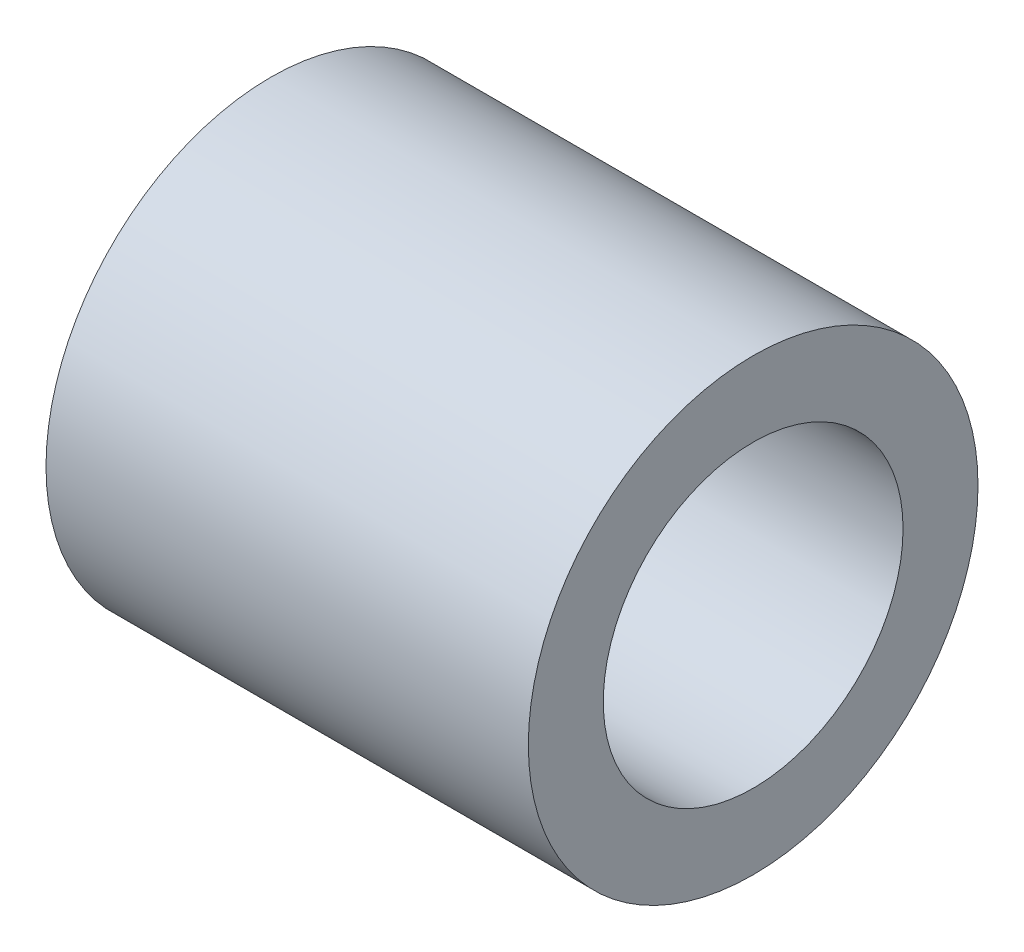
ISO-10303-21;
HEADER;
FILE_DESCRIPTION(('STEP AP214'),'2;1');
FILE_NAME('part.step','',(''),(''),'','','');
FILE_SCHEMA(('AUTOMOTIVE_DESIGN { 1 0 10303 214 1 1 1 1 }'));
ENDSEC;
DATA;
#1=APPLICATION_CONTEXT('core data for automotive mechanical design processes');
#2=APPLICATION_PROTOCOL_DEFINITION('international standard','automotive_design',2000,#1);
#3=PRODUCT_CONTEXT('',#1,'mechanical');
#4=PRODUCT('Part','Part','',(#3));
#5=PRODUCT_RELATED_PRODUCT_CATEGORY('part','',(#4));
#6=PRODUCT_DEFINITION_FORMATION('','',#4);
#7=PRODUCT_DEFINITION_CONTEXT('part definition',#1,'design');
#8=PRODUCT_DEFINITION('design','',#6,#7);
#9=PRODUCT_DEFINITION_SHAPE('','',#8);
#10=(LENGTH_UNIT() NAMED_UNIT(*) SI_UNIT(.MILLI.,.METRE.));
#11=(NAMED_UNIT(*) PLANE_ANGLE_UNIT() SI_UNIT($,.RADIAN.));
#12=(NAMED_UNIT(*) SI_UNIT($,.STERADIAN.) SOLID_ANGLE_UNIT());
#13=UNCERTAINTY_MEASURE_WITH_UNIT(LENGTH_MEASURE(1.E-05),#10,'distance_accuracy_value','');
#14=(GEOMETRIC_REPRESENTATION_CONTEXT(3) GLOBAL_UNCERTAINTY_ASSIGNED_CONTEXT((#13)) GLOBAL_UNIT_ASSIGNED_CONTEXT((#10,
#11,#12)) REPRESENTATION_CONTEXT('',''));
#15=CARTESIAN_POINT('',(0.,0.,0.));
#16=DIRECTION('',(0.,0.,1.));
#17=DIRECTION('',(1.,0.,0.));
#18=AXIS2_PLACEMENT_3D('',#15,#16,#17);
#19=CARTESIAN_POINT('',(40.8686,0.,0.));
#20=DIRECTION('',(1.,0.,0.));
#21=DIRECTION('',(0.,0.,-1.));
#22=AXIS2_PLACEMENT_3D('',#19,#20,#21);
#23=PLANE('',#22);
#24=CARTESIAN_POINT('',(40.8686,0.,0.));
#25=DIRECTION('',(1.,0.,0.));
#26=DIRECTION('',(0.,0.,-1.));
#27=AXIS2_PLACEMENT_3D('',#24,#25,#26);
#28=CIRCLE('',#27,38.1);
#29=CARTESIAN_POINT('',(40.8686,0.,-38.1));
#30=VERTEX_POINT('',#29);
#31=EDGE_CURVE('E11',#30,#30,#28,.T.);
#32=ORIENTED_EDGE('',*,*,#31,.T.);
#33=EDGE_LOOP('',(#32));
#34=FACE_BOUND('',#33,.T.);
#35=CARTESIAN_POINT('',(40.8686,0.,0.));
#36=DIRECTION('',(1.,0.,0.));
#37=DIRECTION('',(0.,0.,-1.));
#38=AXIS2_PLACEMENT_3D('',#35,#36,#37);
#39=CIRCLE('',#38,25.4);
#40=CARTESIAN_POINT('',(40.8686,0.,-25.4));
#41=VERTEX_POINT('',#40);
#42=EDGE_CURVE('E48',#41,#41,#39,.T.);
#43=ORIENTED_EDGE('',*,*,#42,.F.);
#44=EDGE_LOOP('',(#43));
#45=FACE_BOUND('',#44,.T.);
#46=ADVANCED_FACE('F37',(#34,#45),#23,.T.);
#47=CARTESIAN_POINT('',(-40.8686,0.,0.));
#48=DIRECTION('',(1.,0.,0.));
#49=DIRECTION('',(0.,0.,-1.));
#50=AXIS2_PLACEMENT_3D('',#47,#48,#49);
#51=PLANE('',#50);
#52=CARTESIAN_POINT('',(-40.8686,0.,0.));
#53=DIRECTION('',(1.,0.,0.));
#54=DIRECTION('',(0.,0.,-1.));
#55=AXIS2_PLACEMENT_3D('',#52,#53,#54);
#56=CIRCLE('',#55,38.1);
#57=CARTESIAN_POINT('',(-40.8686,0.,-38.1));
#58=VERTEX_POINT('',#57);
#59=EDGE_CURVE('E41',#58,#58,#56,.T.);
#60=ORIENTED_EDGE('',*,*,#59,.F.);
#61=EDGE_LOOP('',(#60));
#62=FACE_BOUND('',#61,.T.);
#63=CARTESIAN_POINT('',(-40.8686,0.,0.));
#64=DIRECTION('',(1.,0.,0.));
#65=DIRECTION('',(0.,0.,-1.));
#66=AXIS2_PLACEMENT_3D('',#63,#64,#65);
#67=CIRCLE('',#66,25.4);
#68=CARTESIAN_POINT('',(-40.8686,0.,-25.4));
#69=VERTEX_POINT('',#68);
#70=EDGE_CURVE('E50',#69,#69,#67,.T.);
#71=ORIENTED_EDGE('',*,*,#70,.T.);
#72=EDGE_LOOP('',(#71));
#73=FACE_BOUND('',#72,.T.);
#74=ADVANCED_FACE('F60',(#62,#73),#51,.F.);
#75=CARTESIAN_POINT('',(40.8686,0.,0.));
#76=DIRECTION('',(-1.,0.,0.));
#77=DIRECTION('',(0.,0.,1.));
#78=AXIS2_PLACEMENT_3D('',#75,#76,#77);
#79=CYLINDRICAL_SURFACE('',#78,38.1);
#80=ORIENTED_EDGE('',*,*,#31,.F.);
#81=EDGE_LOOP('',(#80));
#82=FACE_BOUND('',#81,.T.);
#83=ORIENTED_EDGE('',*,*,#59,.T.);
#84=EDGE_LOOP('',(#83));
#85=FACE_BOUND('',#84,.T.);
#86=ADVANCED_FACE('F39',(#82,#85),#79,.T.);
#87=CARTESIAN_POINT('',(40.8686,0.,0.));
#88=DIRECTION('',(-1.,0.,0.));
#89=DIRECTION('',(0.,0.,1.));
#90=AXIS2_PLACEMENT_3D('',#87,#88,#89);
#91=CYLINDRICAL_SURFACE('',#90,25.4);
#92=ORIENTED_EDGE('',*,*,#42,.T.);
#93=EDGE_LOOP('',(#92));
#94=FACE_BOUND('',#93,.T.);
#95=ORIENTED_EDGE('',*,*,#70,.F.);
#96=EDGE_LOOP('',(#95));
#97=FACE_BOUND('',#96,.T.);
#98=ADVANCED_FACE('F56',(#94,#97),#91,.F.);
#99=CLOSED_SHELL('',(#46,#74,#86,#98));
#100=MANIFOLD_SOLID_BREP('B2',#99);
#101=ADVANCED_BREP_SHAPE_REPRESENTATION('',(#18,#100),#14);
#102=SHAPE_DEFINITION_REPRESENTATION(#9,#101);
ENDSEC;
END-ISO-10303-21;
